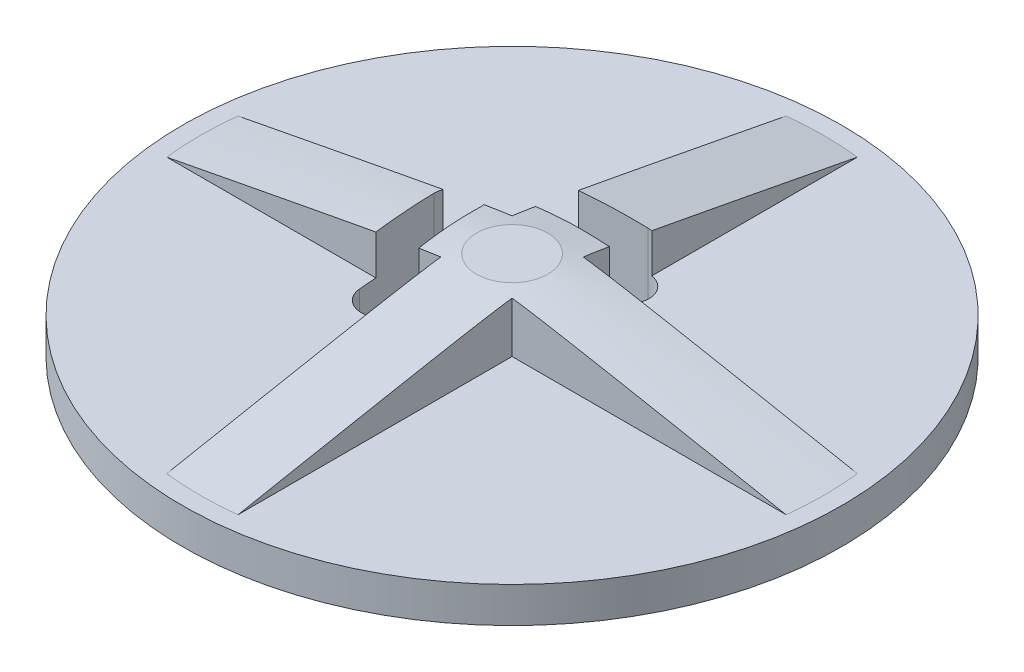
from build123d import *

# Parameters (mm, degrees)
CUT_EXTRUDE1_DEPTH = 38.1
CUT_EXTRUDE3_DEPTH = 339.282803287


with BuildPart() as part:
    # Sketch1 → Revolve1 (revolve)
    with BuildSketch(Plane(origin=(0, 0, 0), x_dir=(0, 0, -1), z_dir=(1, 0, 0))):
        Polygon((190.5, -25.4), (190.5, 0), (234.95, 0), (234.95, 25.4), (222.25, 25.4), (25.4, 63.5), (0, 63.5), (0, 0), (177.8, 0), (177.8, -25.4), align=None)
    revolve(axis=Axis((0, 0, 0), (0, 1, 0)))

    # Sketch2 → Cut-Extrude1 (cut)
    with BuildSketch(Plane(origin=(0, 63.5, 0), x_dir=(1, 0, 0), z_dir=(0, 1, 0))):
        with BuildLine():
            Line((25.4, 233.572991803), (25.4, 25.4))
            Line((25.4, 25.4), (233.572991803, 25.4))
            ThreePointArc((233.572991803, 25.4), (166.13473824, 166.13473824), (25.4, 233.572991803))
        make_face()
        with BuildLine():
            Line((233.572991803, -25.4), (25.4, -25.4))
            Line((25.4, -25.4), (25.4, -233.572991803))
            ThreePointArc((25.4, -233.572991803), (166.13473824, -166.13473824), (233.572991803, -25.4))
        make_face()
        with BuildLine():
            Line((-25.4, -233.572991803), (-25.4, -25.4))
            Line((-25.4, -25.4), (-233.572991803, -25.4))
            ThreePointArc((-233.572991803, -25.4), (-166.13473824, -166.13473824), (-25.4, -233.572991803))
        make_face()
        with BuildLine():
            Line((-233.572991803, 25.4), (-25.4, 25.4))
            Line((-25.4, 25.4), (-25.4, 233.572991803))
            ThreePointArc((-25.4, 233.572991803), (-166.13473824, 166.13473824), (-233.572991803, 25.4))
        make_face()
    extrude(amount=-CUT_EXTRUDE1_DEPTH, mode=Mode.SUBTRACT)

    # Sketch4 → Cut-Extrude3 (cut, through all)
    with BuildSketch(Plane.XZ):
        with BuildLine():
            Line((-75.241413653, -19.44757116), (-70.695690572, 38.030145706))
            ThreePointArc((-70.695690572, 38.030145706), (-54.301599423, 52.02117767), (-40.310567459, 35.627086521))
            Line((-40.310567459, 35.627086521), (-44.85629054, -21.850630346))
            ThreePointArc((-44.85629054, -21.850630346), (-61.250381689, -35.841662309), (-75.241413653, -19.44757116))
        make_face()
        with BuildLine():
            Line((-33.842786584, -41.819815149), (23.778119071, -43.864996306))
            ThreePointArc((23.778119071, -43.864996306), (38.467944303, -59.635989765), (22.696950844, -74.325814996))
            Line((22.696950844, -74.325814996), (-34.923954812, -72.280633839))
            ThreePointArc((-34.923954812, -72.280633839), (-49.613780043, -56.50964038), (-33.842786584, -41.819815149))
        make_face()
    extrude(amount=-CUT_EXTRUDE3_DEPTH, mode=Mode.SUBTRACT)


solid = part.part
